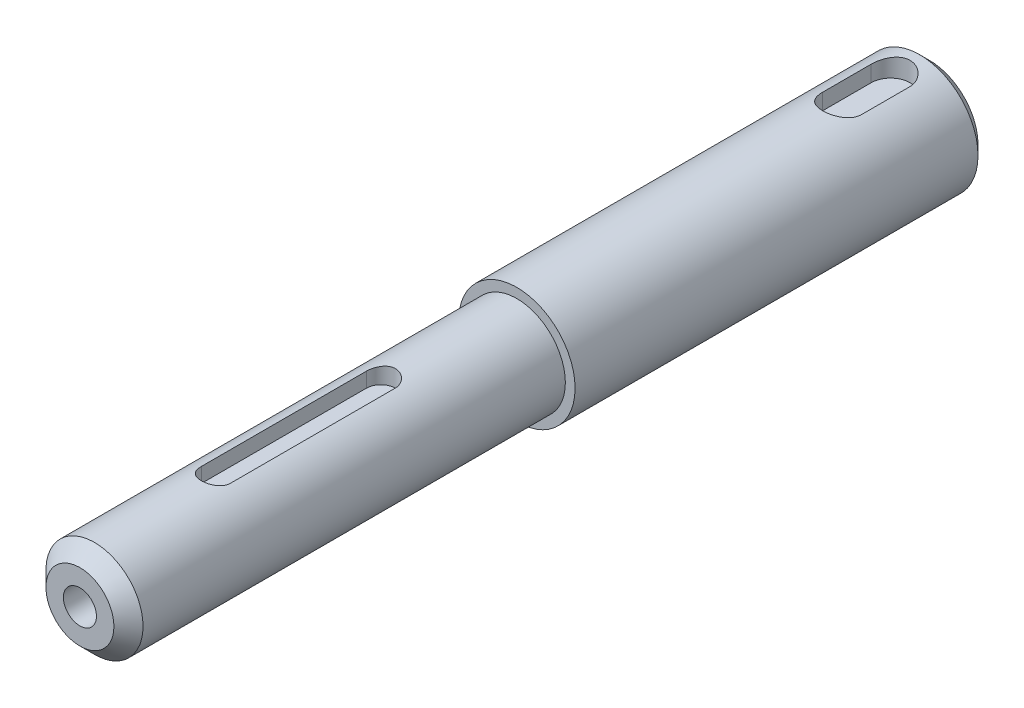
from build123d import *

# Parameters (mm, degrees)
ESQUISSE1_R               = 12
BASE_EXTRUSION_DEPTH      = 85
ESQUISSE2_R               = 10
BOSS_EXTRU_1_DEPTH        = 90
CHANFREIN1_SIZE           = 3
CHANFREIN2_SIZE           = 2
TROU_TARAUD_M8X1_25_D     = 6.8
TROU_TARAUD_M8X1_25_DEPTH = 22
TROU_TARAUD_M8X1_25_TIP   = 2.042926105
ENL_V_MAT_EXTRU_1_DEPTH   = 177.38381445
ENL_V_MAT_EXTRU_2_DEPTH   = 177.547444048


with BuildPart() as part:
    # Esquisse1 → Base-Extrusion (new body)
    with BuildSketch(Plane.XY):
        Circle(ESQUISSE1_R)
    extrude(amount=BASE_EXTRUSION_DEPTH)

    # Esquisse2 → Boss.-Extru.1 (add)
    with BuildSketch(Plane.XY.offset(85)):
        Circle(ESQUISSE2_R)
    extrude(amount=BOSS_EXTRU_1_DEPTH)

    # Chanfrein1
    chanfrein1_edges = [part.edges().sort_by_distance(p)[0] for p in [
        (-10, 0, 175),
    ]]
    chamfer(chanfrein1_edges, length=CHANFREIN1_SIZE)

    # Chanfrein2
    chanfrein2_edges = [part.edges().sort_by_distance(p)[0] for p in [
        (-12, 0, 0),
    ]]
    chamfer(chanfrein2_edges, length=CHANFREIN2_SIZE)

    # Trou taraud_ M8x1.25
    with Locations(Plane.XY.offset(175)):
        with Locations((0, 0)):
            Hole(TROU_TARAUD_M8X1_25_D / 2, depth=TROU_TARAUD_M8X1_25_DEPTH)
            with Locations((0, 0, -(TROU_TARAUD_M8X1_25_DEPTH + TROU_TARAUD_M8X1_25_TIP / 2))):  # 118° drill point
                Cone(0, TROU_TARAUD_M8X1_25_D / 2, TROU_TARAUD_M8X1_25_TIP, mode=Mode.SUBTRACT)

    # Esquisse5 → Enl_v. mat.-Extru.1 (cut, through all)
    with BuildSketch(Plane(origin=(0, 6.5, 0), x_dir=(-1, 0, 0), z_dir=(0, 1, 0))):
        with BuildLine():
            Line((3, 147), (3, 113))
            ThreePointArc((3, 113), (0, 110), (-3, 113))
            Line((-3, 113), (-3, 147))
            ThreePointArc((-3, 147), (0, 150), (3, 147))
        make_face()
    extrude(amount=ENL_V_MAT_EXTRU_1_DEPTH, mode=Mode.SUBTRACT)

    # Esquisse6 → Enl_v. mat.-Extru.2 (cut, through all)
    with BuildSketch(Plane(origin=(0, 8, 0), x_dir=(-1, 0, 0), z_dir=(0, 1, 0))):
        with BuildLine():
            Line((4, 18), (4, 8))
            ThreePointArc((4, 8), (0, 4), (-4, 8))
            Line((-4, 8), (-4, 18))
            ThreePointArc((-4, 18), (0, 22), (4, 18))
        make_face()
    extrude(amount=ENL_V_MAT_EXTRU_2_DEPTH, mode=Mode.SUBTRACT)


solid = part.part
